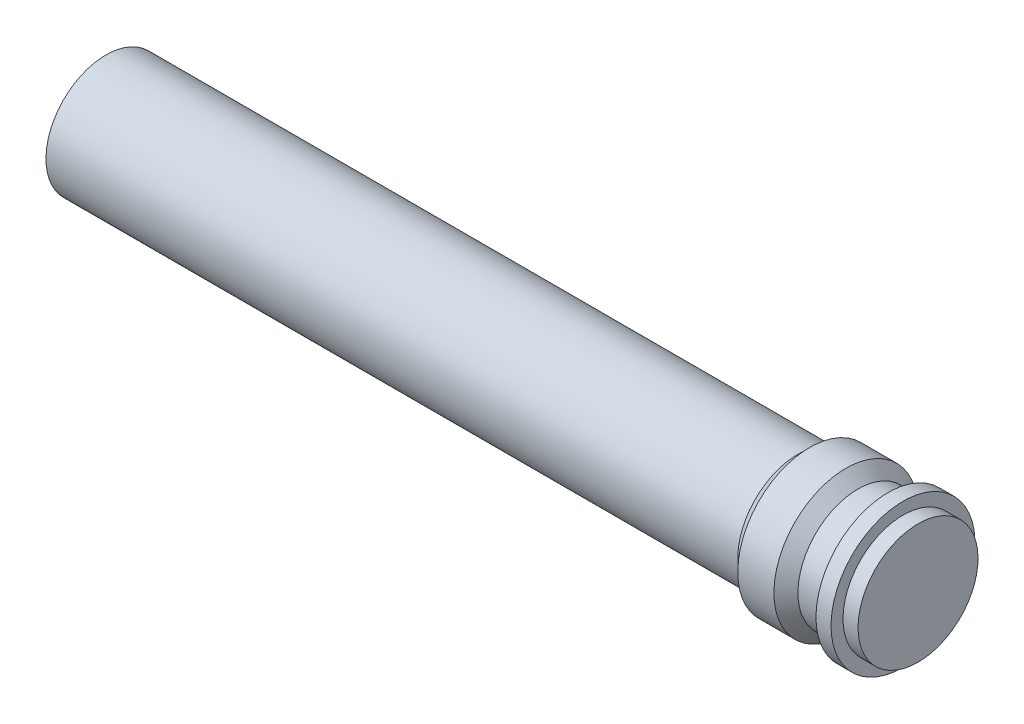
from build123d import *


with BuildPart() as part:
    # Sketch1 → Revolve1 (revolve)
    with BuildSketch(Plane.XY, mode=Mode.PRIVATE) as revolve1_sk:
        Polygon((0, 0), (0, 3.25), (37.481481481, 3.25), (38.131481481, 3.9), (40.090740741, 3.9), (40.740740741, 3.25), (42.37037037, 3.25), (42.37037037, 3.9), (43.185185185, 3.9), (43.185185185, 3.25), (44, 3.25), (44, 0), align=None)
    revolve(revolve1_sk.sketch.rotate(Axis((44, 0, 0), (-1, 0, 0)), 180), axis=Axis((44, 0, 0), (-1, 0, 0)))


solid = part.part
